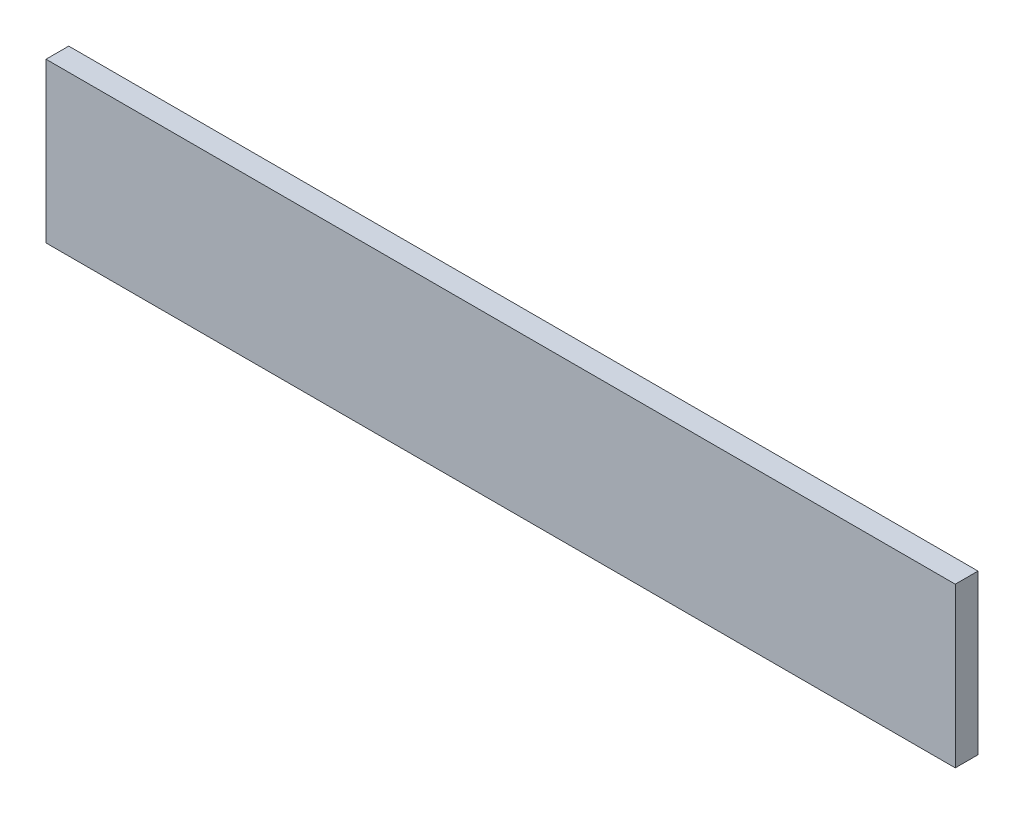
ISO-10303-21;
HEADER;
FILE_DESCRIPTION(('STEP AP214'),'2;1');
FILE_NAME('part.step','',(''),(''),'','','');
FILE_SCHEMA(('AUTOMOTIVE_DESIGN { 1 0 10303 214 1 1 1 1 }'));
ENDSEC;
DATA;
#1=APPLICATION_CONTEXT('core data for automotive mechanical design processes');
#2=APPLICATION_PROTOCOL_DEFINITION('international standard','automotive_design',2000,#1);
#3=PRODUCT_CONTEXT('',#1,'mechanical');
#4=PRODUCT('Part','Part','',(#3));
#5=PRODUCT_RELATED_PRODUCT_CATEGORY('part','',(#4));
#6=PRODUCT_DEFINITION_FORMATION('','',#4);
#7=PRODUCT_DEFINITION_CONTEXT('part definition',#1,'design');
#8=PRODUCT_DEFINITION('design','',#6,#7);
#9=PRODUCT_DEFINITION_SHAPE('','',#8);
#10=(LENGTH_UNIT() NAMED_UNIT(*) SI_UNIT(.MILLI.,.METRE.));
#11=(NAMED_UNIT(*) PLANE_ANGLE_UNIT() SI_UNIT($,.RADIAN.));
#12=(NAMED_UNIT(*) SI_UNIT($,.STERADIAN.) SOLID_ANGLE_UNIT());
#13=UNCERTAINTY_MEASURE_WITH_UNIT(LENGTH_MEASURE(1.E-05),#10,'distance_accuracy_value','');
#14=(GEOMETRIC_REPRESENTATION_CONTEXT(3) GLOBAL_UNCERTAINTY_ASSIGNED_CONTEXT((#13)) GLOBAL_UNIT_ASSIGNED_CONTEXT((#10,
#11,#12)) REPRESENTATION_CONTEXT('',''));
#15=CARTESIAN_POINT('',(0.,0.,0.));
#16=DIRECTION('',(0.,0.,1.));
#17=DIRECTION('',(1.,0.,0.));
#18=AXIS2_PLACEMENT_3D('',#15,#16,#17);
#19=CARTESIAN_POINT('',(0.,0.,6.35));
#20=DIRECTION('',(-1.,0.,0.));
#21=DIRECTION('',(0.,0.,1.));
#22=AXIS2_PLACEMENT_3D('',#19,#20,#21);
#23=PLANE('',#22);
#24=DIRECTION('',(0.,1.,0.));
#25=VECTOR('',#24,1.);
#26=CARTESIAN_POINT('',(0.,0.,0.));
#27=LINE('',#26,#25);
#28=CARTESIAN_POINT('',(0.,0.,0.));
#29=VERTEX_POINT('',#28);
#30=CARTESIAN_POINT('',(0.,44.45,0.));
#31=VERTEX_POINT('',#30);
#32=EDGE_CURVE('E110',#29,#31,#27,.T.);
#33=ORIENTED_EDGE('',*,*,#32,.F.);
#34=DIRECTION('',(0.,0.,-1.));
#35=VECTOR('',#34,1.);
#36=CARTESIAN_POINT('',(0.,0.,6.35));
#37=LINE('',#36,#35);
#38=CARTESIAN_POINT('',(0.,0.,6.35));
#39=VERTEX_POINT('',#38);
#40=EDGE_CURVE('E11',#39,#29,#37,.T.);
#41=ORIENTED_EDGE('',*,*,#40,.F.);
#42=DIRECTION('',(0.,1.,0.));
#43=VECTOR('',#42,1.);
#44=CARTESIAN_POINT('',(0.,0.,6.35));
#45=LINE('',#44,#43);
#46=CARTESIAN_POINT('',(0.,44.45,6.35));
#47=VERTEX_POINT('',#46);
#48=EDGE_CURVE('E103',#39,#47,#45,.T.);
#49=ORIENTED_EDGE('',*,*,#48,.T.);
#50=DIRECTION('',(0.,0.,-1.));
#51=VECTOR('',#50,1.);
#52=CARTESIAN_POINT('',(0.,44.45,6.35));
#53=LINE('',#52,#51);
#54=EDGE_CURVE('E42',#47,#31,#53,.T.);
#55=ORIENTED_EDGE('',*,*,#54,.T.);
#56=EDGE_LOOP('',(#33,#41,#49,#55));
#57=FACE_BOUND('',#56,.T.);
#58=ADVANCED_FACE('F39',(#57),#23,.T.);
#59=CARTESIAN_POINT('',(0.,0.,6.35));
#60=DIRECTION('',(0.,1.,0.));
#61=DIRECTION('',(0.,0.,1.));
#62=AXIS2_PLACEMENT_3D('',#59,#60,#61);
#63=PLANE('',#62);
#64=DIRECTION('',(1.,0.,0.));
#65=VECTOR('',#64,1.);
#66=CARTESIAN_POINT('',(0.,0.,0.));
#67=LINE('',#66,#65);
#68=CARTESIAN_POINT('',(254.,0.,0.));
#69=VERTEX_POINT('',#68);
#70=EDGE_CURVE('E73',#29,#69,#67,.T.);
#71=ORIENTED_EDGE('',*,*,#70,.T.);
#72=DIRECTION('',(0.,0.,-1.));
#73=VECTOR('',#72,1.);
#74=CARTESIAN_POINT('',(254.,0.,6.35));
#75=LINE('',#74,#73);
#76=CARTESIAN_POINT('',(254.,0.,6.35));
#77=VERTEX_POINT('',#76);
#78=EDGE_CURVE('E49',#77,#69,#75,.T.);
#79=ORIENTED_EDGE('',*,*,#78,.F.);
#80=DIRECTION('',(1.,0.,0.));
#81=VECTOR('',#80,1.);
#82=CARTESIAN_POINT('',(0.,0.,6.35));
#83=LINE('',#82,#81);
#84=EDGE_CURVE('E90',#39,#77,#83,.T.);
#85=ORIENTED_EDGE('',*,*,#84,.F.);
#86=ORIENTED_EDGE('',*,*,#40,.T.);
#87=EDGE_LOOP('',(#71,#79,#85,#86));
#88=FACE_BOUND('',#87,.T.);
#89=ADVANCED_FACE('F126',(#88),#63,.F.);
#90=CARTESIAN_POINT('',(254.,0.,6.35));
#91=DIRECTION('',(-1.,0.,0.));
#92=DIRECTION('',(0.,0.,1.));
#93=AXIS2_PLACEMENT_3D('',#90,#91,#92);
#94=PLANE('',#93);
#95=DIRECTION('',(0.,1.,0.));
#96=VECTOR('',#95,1.);
#97=CARTESIAN_POINT('',(254.,0.,0.));
#98=LINE('',#97,#96);
#99=CARTESIAN_POINT('',(254.,44.45,0.));
#100=VERTEX_POINT('',#99);
#101=EDGE_CURVE('E98',#69,#100,#98,.T.);
#102=ORIENTED_EDGE('',*,*,#101,.T.);
#103=DIRECTION('',(0.,0.,-1.));
#104=VECTOR('',#103,1.);
#105=CARTESIAN_POINT('',(254.,44.45,6.35));
#106=LINE('',#105,#104);
#107=CARTESIAN_POINT('',(254.,44.45,6.35));
#108=VERTEX_POINT('',#107);
#109=EDGE_CURVE('E95',#108,#100,#106,.T.);
#110=ORIENTED_EDGE('',*,*,#109,.F.);
#111=DIRECTION('',(0.,1.,0.));
#112=VECTOR('',#111,1.);
#113=CARTESIAN_POINT('',(254.,0.,6.35));
#114=LINE('',#113,#112);
#115=EDGE_CURVE('E85',#77,#108,#114,.T.);
#116=ORIENTED_EDGE('',*,*,#115,.F.);
#117=ORIENTED_EDGE('',*,*,#78,.T.);
#118=EDGE_LOOP('',(#102,#110,#116,#117));
#119=FACE_BOUND('',#118,.T.);
#120=ADVANCED_FACE('F96',(#119),#94,.F.);
#121=CARTESIAN_POINT('',(0.,44.45,6.35));
#122=DIRECTION('',(0.,1.,0.));
#123=DIRECTION('',(0.,0.,1.));
#124=AXIS2_PLACEMENT_3D('',#121,#122,#123);
#125=PLANE('',#124);
#126=DIRECTION('',(1.,0.,0.));
#127=VECTOR('',#126,1.);
#128=CARTESIAN_POINT('',(0.,44.45,0.));
#129=LINE('',#128,#127);
#130=EDGE_CURVE('E114',#31,#100,#129,.T.);
#131=ORIENTED_EDGE('',*,*,#130,.F.);
#132=ORIENTED_EDGE('',*,*,#54,.F.);
#133=DIRECTION('',(1.,0.,0.));
#134=VECTOR('',#133,1.);
#135=CARTESIAN_POINT('',(0.,44.45,6.35));
#136=LINE('',#135,#134);
#137=EDGE_CURVE('E89',#47,#108,#136,.T.);
#138=ORIENTED_EDGE('',*,*,#137,.T.);
#139=ORIENTED_EDGE('',*,*,#109,.T.);
#140=EDGE_LOOP('',(#131,#132,#138,#139));
#141=FACE_BOUND('',#140,.T.);
#142=ADVANCED_FACE('F101',(#141),#125,.T.);
#143=CARTESIAN_POINT('',(0.,0.,6.35));
#144=DIRECTION('',(0.,0.,-1.));
#145=DIRECTION('',(-1.,0.,0.));
#146=AXIS2_PLACEMENT_3D('',#143,#144,#145);
#147=PLANE('',#146);
#148=ORIENTED_EDGE('',*,*,#48,.F.);
#149=ORIENTED_EDGE('',*,*,#84,.T.);
#150=ORIENTED_EDGE('',*,*,#115,.T.);
#151=ORIENTED_EDGE('',*,*,#137,.F.);
#152=EDGE_LOOP('',(#148,#149,#150,#151));
#153=FACE_BOUND('',#152,.T.);
#154=ADVANCED_FACE('F88',(#153),#147,.F.);
#155=CARTESIAN_POINT('',(0.,0.,0.));
#156=DIRECTION('',(0.,0.,-1.));
#157=DIRECTION('',(-1.,0.,0.));
#158=AXIS2_PLACEMENT_3D('',#155,#156,#157);
#159=PLANE('',#158);
#160=ORIENTED_EDGE('',*,*,#32,.T.);
#161=ORIENTED_EDGE('',*,*,#130,.T.);
#162=ORIENTED_EDGE('',*,*,#101,.F.);
#163=ORIENTED_EDGE('',*,*,#70,.F.);
#164=EDGE_LOOP('',(#160,#161,#162,#163));
#165=FACE_BOUND('',#164,.T.);
#166=ADVANCED_FACE('F123',(#165),#159,.T.);
#167=CLOSED_SHELL('',(#58,#89,#120,#142,#154,#166));
#168=MANIFOLD_SOLID_BREP('B2',#167);
#169=ADVANCED_BREP_SHAPE_REPRESENTATION('',(#18,#168),#14);
#170=SHAPE_DEFINITION_REPRESENTATION(#9,#169);
ENDSEC;
END-ISO-10303-21;
